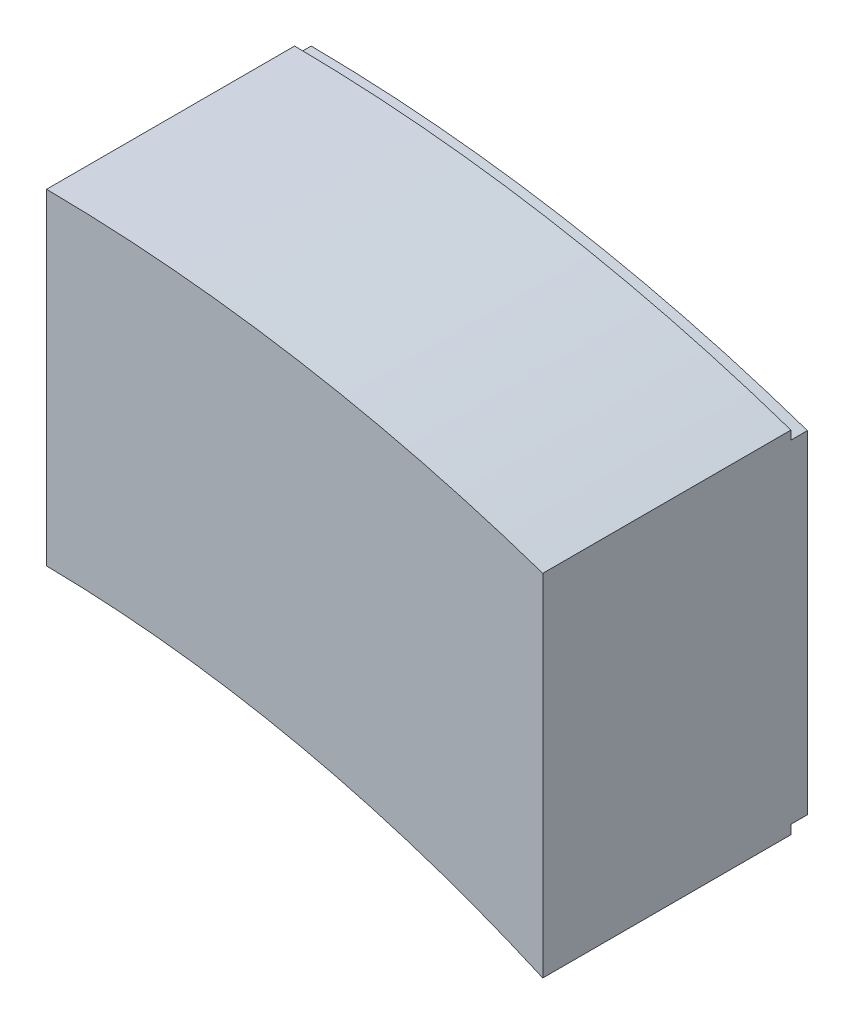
ISO-10303-21;
HEADER;
FILE_DESCRIPTION(('STEP AP214'),'2;1');
FILE_NAME('part.step','',(''),(''),'','','');
FILE_SCHEMA(('AUTOMOTIVE_DESIGN { 1 0 10303 214 1 1 1 1 }'));
ENDSEC;
DATA;
#1=APPLICATION_CONTEXT('core data for automotive mechanical design processes');
#2=APPLICATION_PROTOCOL_DEFINITION('international standard','automotive_design',2000,#1);
#3=PRODUCT_CONTEXT('',#1,'mechanical');
#4=PRODUCT('Part','Part','',(#3));
#5=PRODUCT_RELATED_PRODUCT_CATEGORY('part','',(#4));
#6=PRODUCT_DEFINITION_FORMATION('','',#4);
#7=PRODUCT_DEFINITION_CONTEXT('part definition',#1,'design');
#8=PRODUCT_DEFINITION('design','',#6,#7);
#9=PRODUCT_DEFINITION_SHAPE('','',#8);
#10=(LENGTH_UNIT() NAMED_UNIT(*) SI_UNIT(.MILLI.,.METRE.));
#11=(NAMED_UNIT(*) PLANE_ANGLE_UNIT() SI_UNIT($,.RADIAN.));
#12=(NAMED_UNIT(*) SI_UNIT($,.STERADIAN.) SOLID_ANGLE_UNIT());
#13=UNCERTAINTY_MEASURE_WITH_UNIT(LENGTH_MEASURE(1.E-05),#10,'distance_accuracy_value','');
#14=(GEOMETRIC_REPRESENTATION_CONTEXT(3) GLOBAL_UNCERTAINTY_ASSIGNED_CONTEXT((#13)) GLOBAL_UNIT_ASSIGNED_CONTEXT((#10,
#11,#12)) REPRESENTATION_CONTEXT('',''));
#15=CARTESIAN_POINT('',(0.,0.,0.));
#16=DIRECTION('',(0.,0.,1.));
#17=DIRECTION('',(1.,0.,0.));
#18=AXIS2_PLACEMENT_3D('',#15,#16,#17);
#19=CARTESIAN_POINT('',(-7.99574145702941,-38.1368480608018,15.3558153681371));
#20=DIRECTION('',(0.,0.,-1.));
#21=DIRECTION('',(-1.,0.,0.));
#22=AXIS2_PLACEMENT_3D('',#19,#20,#21);
#23=CYLINDRICAL_SURFACE('',#22,38.14007);
#24=CARTESIAN_POINT('',(-7.99574145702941,-38.1368480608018,-7.5));
#25=DIRECTION('',(0.,0.,1.));
#26=DIRECTION('',(-1.,0.,0.));
#27=AXIS2_PLACEMENT_3D('',#24,#25,#26);
#28=CIRCLE('',#27,38.14007);
#29=CARTESIAN_POINT('',(7.5,-3.28649747,-7.49999999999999));
#30=VERTEX_POINT('',#29);
#31=CARTESIAN_POINT('',(-7.5,0.,-7.5));
#32=VERTEX_POINT('',#31);
#33=EDGE_CURVE('E96',#30,#32,#28,.T.);
#34=ORIENTED_EDGE('',*,*,#33,.F.);
#35=DIRECTION('',(0.,0.,-1.));
#36=VECTOR('',#35,1.);
#37=CARTESIAN_POINT('',(7.5,-3.28649747,15.3558153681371));
#38=LINE('',#37,#36);
#39=CARTESIAN_POINT('',(7.5,-3.28649747,0.));
#40=VERTEX_POINT('',#39);
#41=EDGE_CURVE('E121',#40,#30,#38,.T.);
#42=ORIENTED_EDGE('',*,*,#41,.F.);
#43=CARTESIAN_POINT('',(-7.99574145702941,-38.1368480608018,0.));
#44=DIRECTION('',(0.,0.,-1.));
#45=DIRECTION('',(-1.,0.,0.));
#46=AXIS2_PLACEMENT_3D('',#43,#44,#45);
#47=CIRCLE('',#46,38.14007);
#48=CARTESIAN_POINT('',(-7.50000000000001,0.,0.));
#49=VERTEX_POINT('',#48);
#50=EDGE_CURVE('E115',#40,#49,#47,.F.);
#51=ORIENTED_EDGE('',*,*,#50,.T.);
#52=DIRECTION('',(0.,0.,1.));
#53=VECTOR('',#52,1.);
#54=CARTESIAN_POINT('',(-7.5,0.,-8.));
#55=LINE('',#54,#53);
#56=EDGE_CURVE('E109',#32,#49,#55,.T.);
#57=ORIENTED_EDGE('',*,*,#56,.F.);
#58=EDGE_LOOP('',(#34,#42,#51,#57));
#59=FACE_BOUND('',#58,.T.);
#60=ADVANCED_FACE('F31',(#59),#23,.F.);
#61=CARTESIAN_POINT('',(-7.95500227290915,-38.1368434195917,15.2158771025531));
#62=DIRECTION('',(0.,0.,-1.));
#63=DIRECTION('',(-1.,0.,0.));
#64=AXIS2_PLACEMENT_3D('',#61,#62,#63);
#65=CYLINDRICAL_SURFACE('',#64,48.);
#66=DIRECTION('',(0.,0.,-1.));
#67=VECTOR('',#66,1.);
#68=CARTESIAN_POINT('',(7.5,7.307,-8.));
#69=LINE('',#68,#67);
#70=CARTESIAN_POINT('',(7.49999999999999,7.307,0.));
#71=VERTEX_POINT('',#70);
#72=CARTESIAN_POINT('',(7.5,7.307,-7.5));
#73=VERTEX_POINT('',#72);
#74=EDGE_CURVE('E116',#71,#73,#69,.T.);
#75=ORIENTED_EDGE('',*,*,#74,.T.);
#76=CARTESIAN_POINT('',(-7.95500227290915,-38.1368434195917,-7.5));
#77=DIRECTION('',(0.,0.,-1.));
#78=DIRECTION('',(-1.,0.,0.));
#79=AXIS2_PLACEMENT_3D('',#76,#77,#78);
#80=CIRCLE('',#79,48.);
#81=CARTESIAN_POINT('',(-7.5,9.861,-7.49999999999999));
#82=VERTEX_POINT('',#81);
#83=EDGE_CURVE('E154',#82,#73,#80,.T.);
#84=ORIENTED_EDGE('',*,*,#83,.F.);
#85=DIRECTION('',(0.,0.,-1.));
#86=VECTOR('',#85,1.);
#87=CARTESIAN_POINT('',(-7.49999999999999,9.861,15.2158771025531));
#88=LINE('',#87,#86);
#89=CARTESIAN_POINT('',(-7.49999999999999,9.861,0.));
#90=VERTEX_POINT('',#89);
#91=EDGE_CURVE('E137',#90,#82,#88,.T.);
#92=ORIENTED_EDGE('',*,*,#91,.F.);
#93=CARTESIAN_POINT('',(-7.95500227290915,-38.1368434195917,0.));
#94=DIRECTION('',(0.,0.,-1.));
#95=DIRECTION('',(-1.,0.,0.));
#96=AXIS2_PLACEMENT_3D('',#93,#94,#95);
#97=CIRCLE('',#96,48.);
#98=EDGE_CURVE('E136',#71,#90,#97,.F.);
#99=ORIENTED_EDGE('',*,*,#98,.F.);
#100=EDGE_LOOP('',(#75,#84,#92,#99));
#101=FACE_BOUND('',#100,.T.);
#102=ADVANCED_FACE('F175',(#101),#65,.T.);
#103=CARTESIAN_POINT('',(-7.5,7.307,-8.));
#104=DIRECTION('',(1.,0.,0.));
#105=DIRECTION('',(0.,0.,-1.));
#106=AXIS2_PLACEMENT_3D('',#103,#104,#105);
#107=PLANE('',#106);
#108=DIRECTION('',(0.,-1.,0.));
#109=VECTOR('',#108,1.);
#110=CARTESIAN_POINT('',(-7.5,7.307,-8.));
#111=LINE('',#110,#109);
#112=CARTESIAN_POINT('',(-7.5,9.61098870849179,-8.));
#113=VERTEX_POINT('',#112);
#114=CARTESIAN_POINT('',(-7.5,0.250020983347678,-8.));
#115=VERTEX_POINT('',#114);
#116=EDGE_CURVE('E119',#113,#115,#111,.T.);
#117=ORIENTED_EDGE('',*,*,#116,.T.);
#118=DIRECTION('',(0.,0.,-1.));
#119=VECTOR('',#118,1.);
#120=CARTESIAN_POINT('',(-7.5,0.250020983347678,-7.5));
#121=LINE('',#120,#119);
#122=CARTESIAN_POINT('',(-7.5,0.250020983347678,-7.5));
#123=VERTEX_POINT('',#122);
#124=EDGE_CURVE('E111',#123,#115,#121,.T.);
#125=ORIENTED_EDGE('',*,*,#124,.F.);
#126=DIRECTION('',(0.,1.,0.));
#127=VECTOR('',#126,1.);
#128=CARTESIAN_POINT('',(-7.5,0.,-7.5));
#129=LINE('',#128,#127);
#130=EDGE_CURVE('E99',#32,#123,#129,.T.);
#131=ORIENTED_EDGE('',*,*,#130,.F.);
#132=ORIENTED_EDGE('',*,*,#56,.T.);
#133=DIRECTION('',(0.,-1.,0.));
#134=VECTOR('',#133,1.);
#135=CARTESIAN_POINT('',(-7.49999999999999,7.307,0.));
#136=LINE('',#135,#134);
#137=EDGE_CURVE('E11',#90,#49,#136,.T.);
#138=ORIENTED_EDGE('',*,*,#137,.F.);
#139=ORIENTED_EDGE('',*,*,#91,.T.);
#140=DIRECTION('',(0.,1.,0.));
#141=VECTOR('',#140,1.);
#142=CARTESIAN_POINT('',(-7.5,9.861,-7.5));
#143=LINE('',#142,#141);
#144=CARTESIAN_POINT('',(-7.5,9.61098870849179,-7.5));
#145=VERTEX_POINT('',#144);
#146=EDGE_CURVE('E54',#145,#82,#143,.T.);
#147=ORIENTED_EDGE('',*,*,#146,.F.);
#148=DIRECTION('',(0.,0.,-1.));
#149=VECTOR('',#148,1.);
#150=CARTESIAN_POINT('',(-7.5,9.61098870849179,-7.5));
#151=LINE('',#150,#149);
#152=EDGE_CURVE('E143',#145,#113,#151,.T.);
#153=ORIENTED_EDGE('',*,*,#152,.T.);
#154=EDGE_LOOP('',(#117,#125,#131,#132,#138,#139,#147,#153));
#155=FACE_BOUND('',#154,.T.);
#156=ADVANCED_FACE('F33',(#155),#107,.F.);
#157=CARTESIAN_POINT('',(-7.49999999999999,7.307,0.));
#158=DIRECTION('',(0.,0.,-1.));
#159=DIRECTION('',(-1.,0.,0.));
#160=AXIS2_PLACEMENT_3D('',#157,#158,#159);
#161=PLANE('',#160);
#162=ORIENTED_EDGE('',*,*,#137,.T.);
#163=ORIENTED_EDGE('',*,*,#50,.F.);
#164=DIRECTION('',(0.,-1.,0.));
#165=VECTOR('',#164,1.);
#166=CARTESIAN_POINT('',(7.49999999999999,7.307,0.));
#167=LINE('',#166,#165);
#168=EDGE_CURVE('E39',#71,#40,#167,.T.);
#169=ORIENTED_EDGE('',*,*,#168,.F.);
#170=ORIENTED_EDGE('',*,*,#98,.T.);
#171=EDGE_LOOP('',(#162,#163,#169,#170));
#172=FACE_BOUND('',#171,.T.);
#173=ADVANCED_FACE('F135',(#172),#161,.F.);
#174=CARTESIAN_POINT('',(7.5,7.307,-8.));
#175=DIRECTION('',(-1.,0.,0.));
#176=DIRECTION('',(0.,0.,1.));
#177=AXIS2_PLACEMENT_3D('',#174,#175,#176);
#178=PLANE('',#177);
#179=DIRECTION('',(0.,-1.,0.));
#180=VECTOR('',#179,1.);
#181=CARTESIAN_POINT('',(7.5,-3.28649747,-7.5));
#182=LINE('',#181,#180);
#183=CARTESIAN_POINT('',(7.50000000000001,-3.01307446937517,-7.5));
#184=VERTEX_POINT('',#183);
#185=EDGE_CURVE('E46',#184,#30,#182,.T.);
#186=ORIENTED_EDGE('',*,*,#185,.F.);
#187=DIRECTION('',(0.,0.,-1.));
#188=VECTOR('',#187,1.);
#189=CARTESIAN_POINT('',(7.50000000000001,-3.01307446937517,-7.5));
#190=LINE('',#189,#188);
#191=CARTESIAN_POINT('',(7.50000000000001,-3.01307446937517,-8.));
#192=VERTEX_POINT('',#191);
#193=EDGE_CURVE('E151',#184,#192,#190,.T.);
#194=ORIENTED_EDGE('',*,*,#193,.T.);
#195=DIRECTION('',(0.,-1.,0.));
#196=VECTOR('',#195,1.);
#197=CARTESIAN_POINT('',(7.5,7.307,-8.));
#198=LINE('',#197,#196);
#199=CARTESIAN_POINT('',(7.5,7.04285782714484,-8.));
#200=VERTEX_POINT('',#199);
#201=EDGE_CURVE('E126',#200,#192,#198,.T.);
#202=ORIENTED_EDGE('',*,*,#201,.F.);
#203=DIRECTION('',(0.,0.,-1.));
#204=VECTOR('',#203,1.);
#205=CARTESIAN_POINT('',(7.5,7.04285782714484,-7.5));
#206=LINE('',#205,#204);
#207=CARTESIAN_POINT('',(7.5,7.04285782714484,-7.5));
#208=VERTEX_POINT('',#207);
#209=EDGE_CURVE('E141',#208,#200,#206,.T.);
#210=ORIENTED_EDGE('',*,*,#209,.F.);
#211=DIRECTION('',(0.,-1.,0.));
#212=VECTOR('',#211,1.);
#213=CARTESIAN_POINT('',(7.5,7.307,-7.5));
#214=LINE('',#213,#212);
#215=EDGE_CURVE('E146',#73,#208,#214,.T.);
#216=ORIENTED_EDGE('',*,*,#215,.F.);
#217=ORIENTED_EDGE('',*,*,#74,.F.);
#218=ORIENTED_EDGE('',*,*,#168,.T.);
#219=ORIENTED_EDGE('',*,*,#41,.T.);
#220=EDGE_LOOP('',(#186,#194,#202,#210,#216,#217,#218,#219));
#221=FACE_BOUND('',#220,.T.);
#222=ADVANCED_FACE('F130',(#221),#178,.F.);
#223=CARTESIAN_POINT('',(-7.5,7.307,-8.));
#224=DIRECTION('',(0.,0.,1.));
#225=DIRECTION('',(1.,0.,0.));
#226=AXIS2_PLACEMENT_3D('',#223,#224,#225);
#227=PLANE('',#226);
#228=ORIENTED_EDGE('',*,*,#201,.T.);
#229=CARTESIAN_POINT('',(-7.99574145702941,-38.1368480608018,-8.));
#230=DIRECTION('',(0.,0.,-1.));
#231=DIRECTION('',(-1.,0.,0.));
#232=AXIS2_PLACEMENT_3D('',#229,#230,#231);
#233=CIRCLE('',#232,38.39007);
#234=EDGE_CURVE('E105',#115,#192,#233,.T.);
#235=ORIENTED_EDGE('',*,*,#234,.F.);
#236=ORIENTED_EDGE('',*,*,#116,.F.);
#237=CARTESIAN_POINT('',(-7.95500227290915,-38.1368434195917,-8.));
#238=DIRECTION('',(0.,0.,1.));
#239=DIRECTION('',(-1.,0.,0.));
#240=AXIS2_PLACEMENT_3D('',#237,#238,#239);
#241=CIRCLE('',#240,47.75);
#242=EDGE_CURVE('E148',#200,#113,#241,.T.);
#243=ORIENTED_EDGE('',*,*,#242,.F.);
#244=EDGE_LOOP('',(#228,#235,#236,#243));
#245=FACE_BOUND('',#244,.T.);
#246=ADVANCED_FACE('F169',(#245),#227,.F.);
#247=CARTESIAN_POINT('',(-7.95500227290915,-38.1368434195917,-7.5));
#248=DIRECTION('',(0.,0.,-1.));
#249=DIRECTION('',(-1.,0.,0.));
#250=AXIS2_PLACEMENT_3D('',#247,#248,#249);
#251=CYLINDRICAL_SURFACE('',#250,47.75);
#252=ORIENTED_EDGE('',*,*,#242,.T.);
#253=ORIENTED_EDGE('',*,*,#152,.F.);
#254=CARTESIAN_POINT('',(-7.95500227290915,-38.1368434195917,-7.5));
#255=DIRECTION('',(0.,0.,1.));
#256=DIRECTION('',(-1.,0.,0.));
#257=AXIS2_PLACEMENT_3D('',#254,#255,#256);
#258=CIRCLE('',#257,47.75);
#259=EDGE_CURVE('E150',#208,#145,#258,.T.);
#260=ORIENTED_EDGE('',*,*,#259,.F.);
#261=ORIENTED_EDGE('',*,*,#209,.T.);
#262=EDGE_LOOP('',(#252,#253,#260,#261));
#263=FACE_BOUND('',#262,.T.);
#264=ADVANCED_FACE('F172',(#263),#251,.T.);
#265=CARTESIAN_POINT('',(-7.95500227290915,-38.1368434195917,-7.5));
#266=DIRECTION('',(0.,0.,-1.));
#267=DIRECTION('',(-1.,0.,0.));
#268=AXIS2_PLACEMENT_3D('',#265,#266,#267);
#269=PLANE('',#268);
#270=ORIENTED_EDGE('',*,*,#259,.T.);
#271=ORIENTED_EDGE('',*,*,#146,.T.);
#272=ORIENTED_EDGE('',*,*,#83,.T.);
#273=ORIENTED_EDGE('',*,*,#215,.T.);
#274=EDGE_LOOP('',(#270,#271,#272,#273));
#275=FACE_BOUND('',#274,.T.);
#276=ADVANCED_FACE('F176',(#275),#269,.T.);
#277=CARTESIAN_POINT('',(-7.99574145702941,-38.1368480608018,-7.5));
#278=DIRECTION('',(0.,0.,-1.));
#279=DIRECTION('',(-1.,0.,0.));
#280=AXIS2_PLACEMENT_3D('',#277,#278,#279);
#281=CYLINDRICAL_SURFACE('',#280,38.39007);
#282=ORIENTED_EDGE('',*,*,#234,.T.);
#283=ORIENTED_EDGE('',*,*,#193,.F.);
#284=CARTESIAN_POINT('',(-7.99574145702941,-38.1368480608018,-7.5));
#285=DIRECTION('',(0.,0.,-1.));
#286=DIRECTION('',(-1.,0.,0.));
#287=AXIS2_PLACEMENT_3D('',#284,#285,#286);
#288=CIRCLE('',#287,38.39007);
#289=EDGE_CURVE('E112',#123,#184,#288,.T.);
#290=ORIENTED_EDGE('',*,*,#289,.F.);
#291=ORIENTED_EDGE('',*,*,#124,.T.);
#292=EDGE_LOOP('',(#282,#283,#290,#291));
#293=FACE_BOUND('',#292,.T.);
#294=ADVANCED_FACE('F178',(#293),#281,.F.);
#295=CARTESIAN_POINT('',(-7.99574145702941,-38.1368480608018,-7.5));
#296=DIRECTION('',(0.,0.,-1.));
#297=DIRECTION('',(-1.,0.,0.));
#298=AXIS2_PLACEMENT_3D('',#295,#296,#297);
#299=PLANE('',#298);
#300=ORIENTED_EDGE('',*,*,#33,.T.);
#301=ORIENTED_EDGE('',*,*,#130,.T.);
#302=ORIENTED_EDGE('',*,*,#289,.T.);
#303=ORIENTED_EDGE('',*,*,#185,.T.);
#304=EDGE_LOOP('',(#300,#301,#302,#303));
#305=FACE_BOUND('',#304,.T.);
#306=ADVANCED_FACE('F98',(#305),#299,.T.);
#307=CLOSED_SHELL('',(#60,#102,#156,#173,#222,#246,#264,#276,#294,#306));
#308=MANIFOLD_SOLID_BREP('B2',#307);
#309=ADVANCED_BREP_SHAPE_REPRESENTATION('',(#18,#308),#14);
#310=SHAPE_DEFINITION_REPRESENTATION(#9,#309);
ENDSEC;
END-ISO-10303-21;
